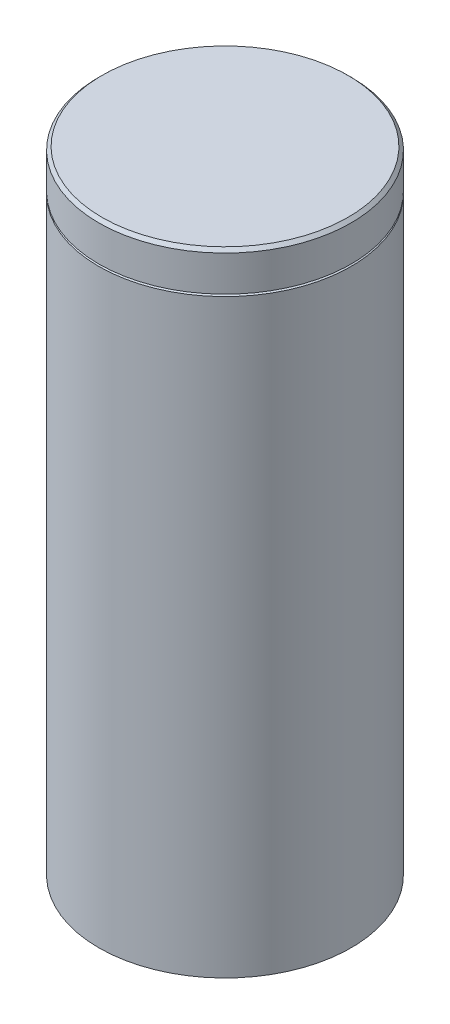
from build123d import *

# Parameters (mm, degrees)
SKETCH1_R           = 20.1168
BOSS_EXTRUDE1_DEPTH = 100.584
SKETCH2_R           = 10.16
CUT_EXTRUDE1_DEPTH  = 2.794
CHAMFER1_SIZE       = 2.54
SKETCH3_R           = 18.917135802
SKETCH3_R_2         = 18.711404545
CUT_EXTRUDE2_DEPTH  = 0.254
CHAMFER2_SIZE       = 0.508


with BuildPart() as part:
    # Sketch1 → Boss-Extrude1 (new body)
    with BuildSketch(Plane(origin=(0, 0, 0), x_dir=(1, 0, 0), z_dir=(0, 1, 0))):
        with Locations(Location((0, 0, 0), (0, 0, 270))):
            Circle(SKETCH1_R)
    extrude(amount=BOSS_EXTRUDE1_DEPTH)

    # Sketch2 → Cut-Extrude1 (cut)
    with BuildSketch(Plane.XZ):
        with Locations(Location((0, 0, 0), (0, 0, 270))):
            Circle(SKETCH2_R)
    extrude(amount=-CUT_EXTRUDE1_DEPTH, mode=Mode.SUBTRACT)

    # Chamfer1
    chamfer1_edges = [part.edges().sort_by_distance(p)[0] for p in [
        (0, 0, 10.16),
    ]]
    chamfer(chamfer1_edges, length=CHAMFER1_SIZE)

    # Sketch3 → Cut-Extrude2 (cut)
    with BuildSketch(Plane.XZ):
        with Locations(Location((0, 0, 0), (0, 0, 270))):
            Circle(SKETCH3_R)
        with Locations(Location((0, 0, 0), (0, 0, 270))):
            Circle(SKETCH3_R_2, mode=Mode.SUBTRACT)
    extrude(amount=-CUT_EXTRUDE2_DEPTH, mode=Mode.SUBTRACT)

    # Chamfer2
    chamfer2_edges = [part.edges().sort_by_distance(p)[0] for p in [
        (0, 100.584, -20.1168),
    ]]
    chamfer(chamfer2_edges, length=CHAMFER2_SIZE)

    # Sketch4 → Cut-Revolve1 (revolve, cut)
    with BuildSketch(Plane(origin=(0, 0, 0), x_dir=(0, 0, -1), z_dir=(1, 0, 0)), mode=Mode.PRIVATE) as cut_revolve1_sk:
        Polygon((35.490178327, 85.192051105), (35.490178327, 103.275948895), (19.829063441, 94.234), align=None)
    revolve(cut_revolve1_sk.sketch.rotate(Axis((0, 100.584, 0), (0, -1, 0)), 180), axis=Axis((0, 100.584, 0), (0, -1, 0)), mode=Mode.SUBTRACT)


solid = part.part
